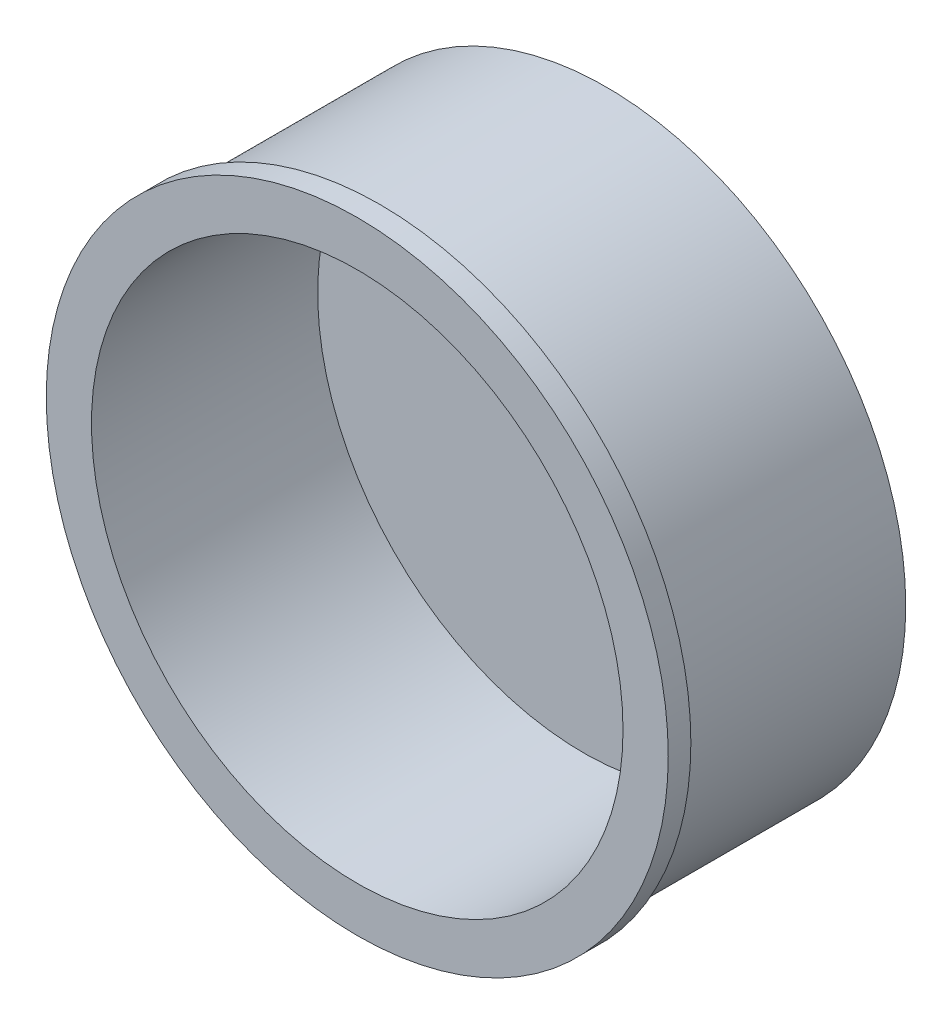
ISO-10303-21;
HEADER;
FILE_DESCRIPTION(('STEP AP214'),'2;1');
FILE_NAME('part.step','',(''),(''),'','','');
FILE_SCHEMA(('AUTOMOTIVE_DESIGN { 1 0 10303 214 1 1 1 1 }'));
ENDSEC;
DATA;
#1=APPLICATION_CONTEXT('core data for automotive mechanical design processes');
#2=APPLICATION_PROTOCOL_DEFINITION('international standard','automotive_design',2000,#1);
#3=PRODUCT_CONTEXT('',#1,'mechanical');
#4=PRODUCT('Part','Part','',(#3));
#5=PRODUCT_RELATED_PRODUCT_CATEGORY('part','',(#4));
#6=PRODUCT_DEFINITION_FORMATION('','',#4);
#7=PRODUCT_DEFINITION_CONTEXT('part definition',#1,'design');
#8=PRODUCT_DEFINITION('design','',#6,#7);
#9=PRODUCT_DEFINITION_SHAPE('','',#8);
#10=(LENGTH_UNIT() NAMED_UNIT(*) SI_UNIT(.MILLI.,.METRE.));
#11=(NAMED_UNIT(*) PLANE_ANGLE_UNIT() SI_UNIT($,.RADIAN.));
#12=(NAMED_UNIT(*) SI_UNIT($,.STERADIAN.) SOLID_ANGLE_UNIT());
#13=UNCERTAINTY_MEASURE_WITH_UNIT(LENGTH_MEASURE(1.E-05),#10,'distance_accuracy_value','');
#14=(GEOMETRIC_REPRESENTATION_CONTEXT(3) GLOBAL_UNCERTAINTY_ASSIGNED_CONTEXT((#13)) GLOBAL_UNIT_ASSIGNED_CONTEXT((#10,
#11,#12)) REPRESENTATION_CONTEXT('',''));
#15=CARTESIAN_POINT('',(0.,0.,0.));
#16=DIRECTION('',(0.,0.,1.));
#17=DIRECTION('',(1.,0.,0.));
#18=AXIS2_PLACEMENT_3D('',#15,#16,#17);
#19=CARTESIAN_POINT('',(-22.994,246.033655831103,0.));
#20=DIRECTION('',(0.,0.,1.));
#21=DIRECTION('',(1.,0.,0.));
#22=AXIS2_PLACEMENT_3D('',#19,#20,#21);
#23=CYLINDRICAL_SURFACE('',#22,13.75);
#24=CARTESIAN_POINT('',(-22.994,246.033655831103,1.00000000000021));
#25=DIRECTION('',(0.,0.,1.));
#26=DIRECTION('',(1.,0.,0.));
#27=AXIS2_PLACEMENT_3D('',#24,#25,#26);
#28=CIRCLE('',#27,13.75);
#29=CARTESIAN_POINT('',(-9.24400000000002,246.033655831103,1.00000000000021));
#30=VERTEX_POINT('',#29);
#31=EDGE_CURVE('E10',#30,#30,#28,.T.);
#32=ORIENTED_EDGE('',*,*,#31,.F.);
#33=EDGE_LOOP('',(#32));
#34=FACE_BOUND('',#33,.T.);
#35=CARTESIAN_POINT('',(-22.994,246.033655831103,2.1025190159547E-13));
#36=DIRECTION('',(0.,0.,1.));
#37=DIRECTION('',(1.,0.,0.));
#38=AXIS2_PLACEMENT_3D('',#35,#36,#37);
#39=CIRCLE('',#38,13.75);
#40=CARTESIAN_POINT('',(-9.24400000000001,246.033655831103,2.08000177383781E-13));
#41=VERTEX_POINT('',#40);
#42=EDGE_CURVE('E54',#41,#41,#39,.T.);
#43=ORIENTED_EDGE('',*,*,#42,.T.);
#44=EDGE_LOOP('',(#43));
#45=FACE_BOUND('',#44,.T.);
#46=ADVANCED_FACE('F32',(#34,#45),#23,.T.);
#47=CARTESIAN_POINT('',(-36.744,246.033655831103,1.00000000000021));
#48=DIRECTION('',(0.,0.,-1.));
#49=DIRECTION('',(-1.,0.,0.));
#50=AXIS2_PLACEMENT_3D('',#47,#48,#49);
#51=PLANE('',#50);
#52=CARTESIAN_POINT('',(-22.994,246.033655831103,1.00000000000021));
#53=DIRECTION('',(0.,0.,1.));
#54=DIRECTION('',(1.,0.,0.));
#55=AXIS2_PLACEMENT_3D('',#52,#53,#54);
#56=CIRCLE('',#55,11.75);
#57=CARTESIAN_POINT('',(-11.244,246.033655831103,1.00000000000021));
#58=VERTEX_POINT('',#57);
#59=EDGE_CURVE('E38',#58,#58,#56,.T.);
#60=ORIENTED_EDGE('',*,*,#59,.F.);
#61=EDGE_LOOP('',(#60));
#62=FACE_BOUND('',#61,.T.);
#63=ORIENTED_EDGE('',*,*,#31,.T.);
#64=EDGE_LOOP('',(#63));
#65=FACE_BOUND('',#64,.T.);
#66=ADVANCED_FACE('F82',(#62,#65),#51,.F.);
#67=CARTESIAN_POINT('',(-22.994,246.033655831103,0.));
#68=DIRECTION('',(0.,0.,1.));
#69=DIRECTION('',(1.,0.,0.));
#70=AXIS2_PLACEMENT_3D('',#67,#68,#69);
#71=CYLINDRICAL_SURFACE('',#70,11.75);
#72=CARTESIAN_POINT('',(-22.994,246.033655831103,-8.99999999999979));
#73=DIRECTION('',(0.,0.,1.));
#74=DIRECTION('',(1.,0.,0.));
#75=AXIS2_PLACEMENT_3D('',#72,#73,#74);
#76=CIRCLE('',#75,11.75);
#77=CARTESIAN_POINT('',(-11.244,246.033655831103,-8.99999999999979));
#78=VERTEX_POINT('',#77);
#79=EDGE_CURVE('E42',#78,#78,#76,.T.);
#80=ORIENTED_EDGE('',*,*,#79,.F.);
#81=EDGE_LOOP('',(#80));
#82=FACE_BOUND('',#81,.T.);
#83=ORIENTED_EDGE('',*,*,#59,.T.);
#84=EDGE_LOOP('',(#83));
#85=FACE_BOUND('',#84,.T.);
#86=ADVANCED_FACE('F78',(#82,#85),#71,.F.);
#87=CARTESIAN_POINT('',(-34.744,246.033655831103,-8.99999999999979));
#88=DIRECTION('',(0.,0.,-1.));
#89=DIRECTION('',(-1.,0.,0.));
#90=AXIS2_PLACEMENT_3D('',#87,#88,#89);
#91=PLANE('',#90);
#92=ORIENTED_EDGE('',*,*,#79,.T.);
#93=EDGE_LOOP('',(#92));
#94=FACE_BOUND('',#93,.T.);
#95=ADVANCED_FACE('F73',(#94),#91,.F.);
#96=CARTESIAN_POINT('',(-22.994,246.033655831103,-9.99999999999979));
#97=DIRECTION('',(0.,0.,1.));
#98=DIRECTION('',(1.,0.,0.));
#99=AXIS2_PLACEMENT_3D('',#96,#97,#98);
#100=PLANE('',#99);
#101=CARTESIAN_POINT('',(-22.994,246.033655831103,-9.99999999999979));
#102=DIRECTION('',(0.,0.,1.));
#103=DIRECTION('',(1.,0.,0.));
#104=AXIS2_PLACEMENT_3D('',#101,#102,#103);
#105=CIRCLE('',#104,13.25);
#106=CARTESIAN_POINT('',(-9.74400000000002,246.033655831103,-9.99999999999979));
#107=VERTEX_POINT('',#106);
#108=EDGE_CURVE('E46',#107,#107,#105,.T.);
#109=ORIENTED_EDGE('',*,*,#108,.F.);
#110=EDGE_LOOP('',(#109));
#111=FACE_BOUND('',#110,.T.);
#112=ADVANCED_FACE('F68',(#111),#100,.F.);
#113=CARTESIAN_POINT('',(-22.994,246.033655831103,0.));
#114=DIRECTION('',(0.,0.,1.));
#115=DIRECTION('',(1.,0.,0.));
#116=AXIS2_PLACEMENT_3D('',#113,#114,#115);
#117=CYLINDRICAL_SURFACE('',#116,13.25);
#118=CARTESIAN_POINT('',(-22.994,246.033655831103,0.));
#119=DIRECTION('',(0.,0.,1.));
#120=DIRECTION('',(1.,0.,0.));
#121=AXIS2_PLACEMENT_3D('',#118,#119,#120);
#122=CIRCLE('',#121,13.25);
#123=CARTESIAN_POINT('',(-9.74400000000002,246.033655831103,0.));
#124=VERTEX_POINT('',#123);
#125=EDGE_CURVE('E51',#124,#124,#122,.T.);
#126=ORIENTED_EDGE('',*,*,#125,.F.);
#127=EDGE_LOOP('',(#126));
#128=FACE_BOUND('',#127,.T.);
#129=ORIENTED_EDGE('',*,*,#108,.T.);
#130=EDGE_LOOP('',(#129));
#131=FACE_BOUND('',#130,.T.);
#132=ADVANCED_FACE('F62',(#128,#131),#117,.T.);
#133=CARTESIAN_POINT('',(-36.244,246.033655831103,1.06210872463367E-13));
#134=DIRECTION('',(0.,0.,1.));
#135=DIRECTION('',(1.,0.,0.));
#136=AXIS2_PLACEMENT_3D('',#133,#134,#135);
#137=PLANE('',#136);
#138=ORIENTED_EDGE('',*,*,#42,.F.);
#139=EDGE_LOOP('',(#138));
#140=FACE_BOUND('',#139,.T.);
#141=ORIENTED_EDGE('',*,*,#125,.T.);
#142=EDGE_LOOP('',(#141));
#143=FACE_BOUND('',#142,.T.);
#144=ADVANCED_FACE('F59',(#140,#143),#137,.F.);
#145=CLOSED_SHELL('',(#46,#66,#86,#95,#112,#132,#144));
#146=MANIFOLD_SOLID_BREP('B2',#145);
#147=ADVANCED_BREP_SHAPE_REPRESENTATION('',(#18,#146),#14);
#148=SHAPE_DEFINITION_REPRESENTATION(#9,#147);
ENDSEC;
END-ISO-10303-21;
